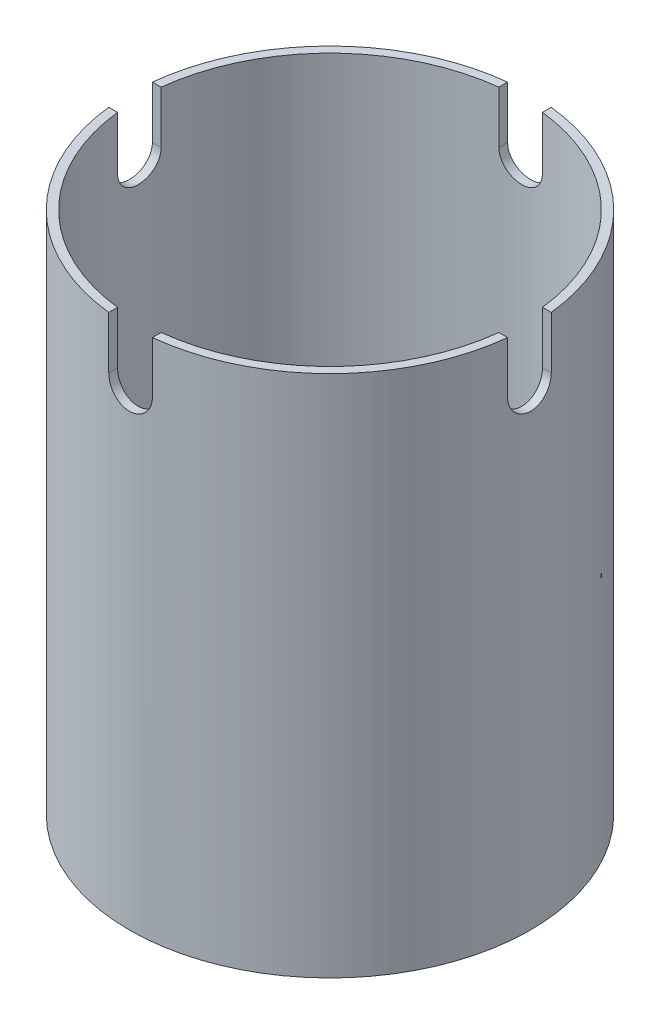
ISO-10303-21;
HEADER;
FILE_DESCRIPTION(('STEP AP214'),'2;1');
FILE_NAME('part.step','',(''),(''),'','','');
FILE_SCHEMA(('AUTOMOTIVE_DESIGN { 1 0 10303 214 1 1 1 1 }'));
ENDSEC;
DATA;
#1=APPLICATION_CONTEXT('core data for automotive mechanical design processes');
#2=APPLICATION_PROTOCOL_DEFINITION('international standard','automotive_design',2000,#1);
#3=PRODUCT_CONTEXT('',#1,'mechanical');
#4=PRODUCT('Part','Part','',(#3));
#5=PRODUCT_RELATED_PRODUCT_CATEGORY('part','',(#4));
#6=PRODUCT_DEFINITION_FORMATION('','',#4);
#7=PRODUCT_DEFINITION_CONTEXT('part definition',#1,'design');
#8=PRODUCT_DEFINITION('design','',#6,#7);
#9=PRODUCT_DEFINITION_SHAPE('','',#8);
#10=(LENGTH_UNIT() NAMED_UNIT(*) SI_UNIT(.MILLI.,.METRE.));
#11=(NAMED_UNIT(*) PLANE_ANGLE_UNIT() SI_UNIT($,.RADIAN.));
#12=(NAMED_UNIT(*) SI_UNIT($,.STERADIAN.) SOLID_ANGLE_UNIT());
#13=UNCERTAINTY_MEASURE_WITH_UNIT(LENGTH_MEASURE(1.E-05),#10,'distance_accuracy_value','');
#14=(GEOMETRIC_REPRESENTATION_CONTEXT(3) GLOBAL_UNCERTAINTY_ASSIGNED_CONTEXT((#13)) GLOBAL_UNIT_ASSIGNED_CONTEXT((#10,
#11,#12)) REPRESENTATION_CONTEXT('',''));
#15=CARTESIAN_POINT('',(0.,0.,0.));
#16=DIRECTION('',(0.,0.,1.));
#17=DIRECTION('',(1.,0.,0.));
#18=AXIS2_PLACEMENT_3D('',#15,#16,#17);
#19=CARTESIAN_POINT('',(0.,392.,0.));
#20=DIRECTION('',(0.,1.,0.));
#21=DIRECTION('',(0.,0.,1.));
#22=AXIS2_PLACEMENT_3D('',#19,#20,#21);
#23=CYLINDRICAL_SURFACE('',#22,11.);
#24=CARTESIAN_POINT('',(0.,392.,0.));
#25=DIRECTION('',(0.,1.,0.));
#26=DIRECTION('',(0.,0.,1.));
#27=AXIS2_PLACEMENT_3D('',#24,#25,#26);
#28=CIRCLE('',#27,11.);
#29=CARTESIAN_POINT('',(0.,392.,11.));
#30=VERTEX_POINT('',#29);
#31=EDGE_CURVE('E239',#30,#30,#28,.F.);
#32=ORIENTED_EDGE('',*,*,#31,.T.);
#33=EDGE_LOOP('',(#32));
#34=FACE_BOUND('',#33,.T.);
#35=DIRECTION('',(0.,1.,0.));
#36=VECTOR('',#35,1.);
#37=CARTESIAN_POINT('',(-1.24999999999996,422.,10.9287464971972));
#38=LINE('',#37,#36);
#39=CARTESIAN_POINT('',(-1.24999999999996,422.,10.9287464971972));
#40=VERTEX_POINT('',#39);
#41=CARTESIAN_POINT('',(-1.24999999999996,419.,10.9287464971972));
#42=VERTEX_POINT('',#41);
#43=EDGE_CURVE('E128',#40,#42,#38,.F.);
#44=ORIENTED_EDGE('',*,*,#43,.T.);
#45=CARTESIAN_POINT('',(-1.24999999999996,419.,10.9287464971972));
#46=CARTESIAN_POINT('',(-1.24999990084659,418.964953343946,10.9287455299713));
#47=CARTESIAN_POINT('',(-1.24852515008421,418.929923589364,10.9289152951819));
#48=CARTESIAN_POINT('',(-1.2426426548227,418.860116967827,10.9295860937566));
#49=CARTESIAN_POINT('',(-1.23823512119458,418.825340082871,10.9300871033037));
#50=CARTESIAN_POINT('',(-1.22065923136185,418.72183778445,10.9320692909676));
#51=CARTESIAN_POINT('',(-1.20313744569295,418.653809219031,10.9340297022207));
#52=CARTESIAN_POINT('',(-1.15698733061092,418.521684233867,10.9390087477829));
#53=CARTESIAN_POINT('',(-1.12835490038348,418.4575892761,10.9420277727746));
#54=CARTESIAN_POINT('',(-1.06080766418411,418.33511321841,10.9487823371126));
#55=CARTESIAN_POINT('',(-1.02189430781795,418.276731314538,10.9525177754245));
#56=CARTESIAN_POINT('',(-0.934705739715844,418.16708221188,10.9603030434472));
#57=CARTESIAN_POINT('',(-0.886394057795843,418.115844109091,10.9643540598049));
#58=CARTESIAN_POINT('',(-0.781837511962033,418.022166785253,10.9723048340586));
#59=CARTESIAN_POINT('',(-0.725589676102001,417.979730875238,10.9762045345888));
#60=CARTESIAN_POINT('',(-0.606564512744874,417.904763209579,10.9834258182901));
#61=CARTESIAN_POINT('',(-0.543767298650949,417.872262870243,10.9867455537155));
#62=CARTESIAN_POINT('',(-0.413610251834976,417.818315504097,10.9924133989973));
#63=CARTESIAN_POINT('',(-0.346255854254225,417.796855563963,10.994762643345));
#64=CARTESIAN_POINT('',(-0.232112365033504,417.770851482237,10.9976454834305));
#65=CARTESIAN_POINT('',(-0.186049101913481,417.763043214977,10.9985242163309));
#66=CARTESIAN_POINT('',(-0.0933305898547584,417.752616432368,10.9997017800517));
#67=CARTESIAN_POINT('',(-0.0466753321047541,417.749997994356,11.0000006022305));
#68=CARTESIAN_POINT('',(0.0699714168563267,417.750003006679,10.9999990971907));
#69=CARTESIAN_POINT('',(0.139987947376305,417.7558950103,10.9993252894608));
#70=CARTESIAN_POINT('',(0.278075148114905,417.779308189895,10.9967021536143));
#71=CARTESIAN_POINT('',(0.346143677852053,417.796841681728,10.9947514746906));
#72=CARTESIAN_POINT('',(0.478316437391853,417.843017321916,10.989794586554));
#73=CARTESIAN_POINT('',(0.54242318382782,417.871652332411,10.9867890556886));
#74=CARTESIAN_POINT('',(0.664908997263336,417.939204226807,10.9800575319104));
#75=CARTESIAN_POINT('',(0.723289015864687,417.978119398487,10.9763316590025));
#76=CARTESIAN_POINT('',(0.83294211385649,418.065316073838,10.9685571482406));
#77=CARTESIAN_POINT('',(0.884185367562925,418.113634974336,10.9645072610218));
#78=CARTESIAN_POINT('',(0.977856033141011,418.218191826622,10.9565511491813));
#79=CARTESIAN_POINT('',(1.02028267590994,418.274430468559,10.9526449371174));
#80=CARTESIAN_POINT('',(1.09523073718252,418.393427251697,10.9454052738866));
#81=CARTESIAN_POINT('',(1.12772199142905,418.456204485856,10.942073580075));
#82=CARTESIAN_POINT('',(1.1816754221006,418.586359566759,10.9363789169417));
#83=CARTESIAN_POINT('',(1.20314372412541,418.653734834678,10.9340154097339));
#84=CARTESIAN_POINT('',(1.22915713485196,418.767929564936,10.9311152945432));
#85=CARTESIAN_POINT('',(1.23696739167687,418.814022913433,10.9302314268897));
#86=CARTESIAN_POINT('',(1.24738870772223,418.906737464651,10.9290452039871));
#87=CARTESIAN_POINT('',(1.25000679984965,418.953357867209,10.9287420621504));
#88=CARTESIAN_POINT('',(1.25000000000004,419.,10.9287464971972));
#89=B_SPLINE_CURVE_WITH_KNOTS('',3,(#45,#46,#47,#48,#49,#50,#51,#52,#53,#54,#55,#56,#57,#58,#59,
#60,#61,#62,#63,#64,#65,#66,#67,#68,#69,#70,#71,#72,#73,#74,#75,#76,#77,#78,#79,#80,#81,#82,#83,
#84,#85,#86,#87,#88),.UNSPECIFIED.,.F.,.F.,(4,2,2,2,2,2,2,2,2,2,2,2,2,2,2,2,2,2,2,2,2,4),(0.,
0.105075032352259,0.210142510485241,0.419887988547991,0.629710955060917,0.839504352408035,
1.0501287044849,1.26083214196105,1.4721950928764,1.68331025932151,1.82322044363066,
1.96313271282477,2.17287647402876,2.38284248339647,2.59267371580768,2.80247002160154,
3.01311835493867,3.22378505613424,3.43508514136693,3.64626767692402,3.7862674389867,
3.9260774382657),.UNSPECIFIED.);
#90=CARTESIAN_POINT('',(1.25000000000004,419.,10.9287464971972));
#91=VERTEX_POINT('',#90);
#92=EDGE_CURVE('E296',#42,#91,#89,.T.);
#93=ORIENTED_EDGE('',*,*,#92,.T.);
#94=DIRECTION('',(0.,1.,0.));
#95=VECTOR('',#94,1.);
#96=CARTESIAN_POINT('',(1.25000000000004,419.,10.9287464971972));
#97=LINE('',#96,#95);
#98=CARTESIAN_POINT('',(1.25000000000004,422.,10.9287464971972));
#99=VERTEX_POINT('',#98);
#100=EDGE_CURVE('E158',#91,#99,#97,.T.);
#101=ORIENTED_EDGE('',*,*,#100,.T.);
#102=CARTESIAN_POINT('',(0.,422.,0.));
#103=DIRECTION('',(0.,1.,0.));
#104=DIRECTION('',(0.,0.,1.));
#105=AXIS2_PLACEMENT_3D('',#102,#103,#104);
#106=CIRCLE('',#105,11.);
#107=CARTESIAN_POINT('',(10.9287464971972,422.,1.25));
#108=VERTEX_POINT('',#107);
#109=EDGE_CURVE('E161',#108,#99,#106,.F.);
#110=ORIENTED_EDGE('',*,*,#109,.F.);
#111=DIRECTION('',(0.,-1.,0.));
#112=VECTOR('',#111,1.);
#113=CARTESIAN_POINT('',(10.9287464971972,419.,1.25));
#114=LINE('',#113,#112);
#115=CARTESIAN_POINT('',(10.9287464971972,419.,1.25));
#116=VERTEX_POINT('',#115);
#117=EDGE_CURVE('E163',#108,#116,#114,.T.);
#118=ORIENTED_EDGE('',*,*,#117,.T.);
#119=CARTESIAN_POINT('',(10.9287464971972,419.,1.25));
#120=CARTESIAN_POINT('',(10.9287455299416,418.964953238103,1.24999990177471));
#121=CARTESIAN_POINT('',(10.9289152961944,418.929923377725,1.24852514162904));
#122=CARTESIAN_POINT('',(10.9295860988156,418.860116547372,1.24264261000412));
#123=CARTESIAN_POINT('',(10.9300871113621,418.825339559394,1.23823504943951));
#124=CARTESIAN_POINT('',(10.9320693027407,418.721837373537,1.22065912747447));
#125=CARTESIAN_POINT('',(10.9340297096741,418.653809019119,1.20313738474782));
#126=CARTESIAN_POINT('',(10.9390086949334,418.52168563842,1.15698781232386));
#127=CARTESIAN_POINT('',(10.9420276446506,418.457592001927,1.12835608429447));
#128=CARTESIAN_POINT('',(10.9487821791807,418.335115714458,1.06080936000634));
#129=CARTESIAN_POINT('',(10.9525176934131,418.276732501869,1.02189537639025));
#130=CARTESIAN_POINT('',(10.9603034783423,418.16707605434,0.934700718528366));
#131=CARTESIAN_POINT('',(10.9643549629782,418.115832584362,0.886382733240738));
#132=CARTESIAN_POINT('',(10.9723057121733,418.022157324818,0.78182541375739));
#133=CARTESIAN_POINT('',(10.9762049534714,417.979726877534,0.725584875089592));
#134=CARTESIAN_POINT('',(10.9834238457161,417.904783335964,0.606594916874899));
#135=CARTESIAN_POINT('',(10.9867419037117,417.872297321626,0.543828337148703));
#136=CARTESIAN_POINT('',(10.9924108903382,417.818339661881,0.413690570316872));
#137=CARTESIAN_POINT('',(10.9947619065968,417.796867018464,0.346319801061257));
#138=CARTESIAN_POINT('',(10.9982235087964,417.765632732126,0.209191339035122));
#139=CARTESIAN_POINT('',(10.999339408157,417.755820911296,0.139445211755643));
#140=CARTESIAN_POINT('',(11.0002231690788,417.748031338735,-0.000713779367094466));
#141=CARTESIAN_POINT('',(10.9999910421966,417.750053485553,-0.071126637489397));
#142=CARTESIAN_POINT('',(10.9982091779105,417.765834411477,-0.210275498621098));
#143=CARTESIAN_POINT('',(10.9966655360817,417.779538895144,-0.279017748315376));
#144=CARTESIAN_POINT('',(10.9924410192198,417.818210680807,-0.413219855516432));
#145=CARTESIAN_POINT('',(10.9897601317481,417.843178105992,-0.478679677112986));
#146=CARTESIAN_POINT('',(10.9835518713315,417.903726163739,-0.604629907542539));
#147=CARTESIAN_POINT('',(10.9800225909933,417.939330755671,-0.66510870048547));
#148=CARTESIAN_POINT('',(10.9725131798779,418.020123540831,-0.77925040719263));
#149=CARTESIAN_POINT('',(10.968533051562,418.065311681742,-0.832913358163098));
#150=CARTESIAN_POINT('',(10.9605417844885,418.164286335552,-0.932214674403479));
#151=CARTESIAN_POINT('',(10.9565305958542,418.218118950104,-0.977807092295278));
#152=CARTESIAN_POINT('',(10.9489498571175,418.332717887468,-1.05932965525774));
#153=CARTESIAN_POINT('',(10.9453804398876,418.393486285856,-1.0952568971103));
#154=CARTESIAN_POINT('',(10.9390868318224,418.520278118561,-1.15642963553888));
#155=CARTESIAN_POINT('',(10.9363634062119,418.586306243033,-1.18166546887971));
#156=CARTESIAN_POINT('',(10.9320823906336,418.721652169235,-1.22064143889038));
#157=CARTESIAN_POINT('',(10.9305230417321,418.790964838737,-1.23439892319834));
#158=CARTESIAN_POINT('',(10.9293375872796,418.883974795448,-1.24482230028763));
#159=CARTESIAN_POINT('',(10.9291160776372,418.90715731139,-1.24676487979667));
#160=CARTESIAN_POINT('',(10.9288207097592,418.953556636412,-1.24935198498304));
#161=CARTESIAN_POINT('',(10.9287466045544,418.976773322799,-1.24999868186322));
#162=CARTESIAN_POINT('',(10.9287464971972,419.,-1.25));
#163=B_SPLINE_CURVE_WITH_KNOTS('',3,(#119,#120,#121,#122,#123,#124,#125,#126,#127,#128,#129,
#130,#131,#132,#133,#134,#135,#136,#137,#138,#139,#140,#141,#142,#143,#144,#145,#146,#147,#148,
#149,#150,#151,#152,#153,#154,#155,#156,#157,#158,#159,#160,#161,#162),.UNSPECIFIED.,.F.,.F.,(4,
2,2,2,2,2,2,2,2,2,2,2,2,2,2,2,2,2,2,2,2,4),(0.,0.105075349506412,0.210143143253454,
0.419887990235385,0.629706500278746,0.839504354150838,1.05015221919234,1.26083214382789,
1.47208077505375,1.6833102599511,1.89362746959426,2.10394287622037,2.31328610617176,
2.52263162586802,2.73245228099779,2.9422717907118,3.15324990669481,3.36429132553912,
3.57552308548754,3.78643502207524,3.85620296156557,3.92585390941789),.UNSPECIFIED.);
#164=CARTESIAN_POINT('',(10.9287464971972,419.,-1.25));
#165=VERTEX_POINT('',#164);
#166=EDGE_CURVE('E286',#116,#165,#163,.T.);
#167=ORIENTED_EDGE('',*,*,#166,.T.);
#168=DIRECTION('',(0.,1.,0.));
#169=VECTOR('',#168,1.);
#170=CARTESIAN_POINT('',(10.9287464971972,422.,-1.25));
#171=LINE('',#170,#169);
#172=CARTESIAN_POINT('',(10.9287464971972,422.,-1.25));
#173=VERTEX_POINT('',#172);
#174=EDGE_CURVE('E167',#165,#173,#171,.T.);
#175=ORIENTED_EDGE('',*,*,#174,.T.);
#176=CARTESIAN_POINT('',(0.,422.,0.));
#177=DIRECTION('',(0.,1.,0.));
#178=DIRECTION('',(0.,0.,1.));
#179=AXIS2_PLACEMENT_3D('',#176,#177,#178);
#180=CIRCLE('',#179,11.);
#181=CARTESIAN_POINT('',(1.24999999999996,422.,-10.9287464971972));
#182=VERTEX_POINT('',#181);
#183=EDGE_CURVE('E170',#182,#173,#180,.F.);
#184=ORIENTED_EDGE('',*,*,#183,.F.);
#185=DIRECTION('',(0.,1.,0.));
#186=VECTOR('',#185,1.);
#187=CARTESIAN_POINT('',(1.24999999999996,419.,-10.9287464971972));
#188=LINE('',#187,#186);
#189=CARTESIAN_POINT('',(1.24999999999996,419.,-10.9287464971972));
#190=VERTEX_POINT('',#189);
#191=EDGE_CURVE('E171',#182,#190,#188,.F.);
#192=ORIENTED_EDGE('',*,*,#191,.T.);
#193=CARTESIAN_POINT('',(1.24999999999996,419.,-10.9287464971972));
#194=CARTESIAN_POINT('',(1.24999990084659,418.964953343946,-10.9287455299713));
#195=CARTESIAN_POINT('',(1.24852515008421,418.929923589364,-10.9289152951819));
#196=CARTESIAN_POINT('',(1.2426426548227,418.860116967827,-10.9295860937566));
#197=CARTESIAN_POINT('',(1.23823512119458,418.825340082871,-10.9300871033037));
#198=CARTESIAN_POINT('',(1.22065923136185,418.72183778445,-10.9320692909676));
#199=CARTESIAN_POINT('',(1.20313744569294,418.653809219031,-10.9340297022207));
#200=CARTESIAN_POINT('',(1.15698733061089,418.521684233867,-10.9390087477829));
#201=CARTESIAN_POINT('',(1.12835490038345,418.4575892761,-10.9420277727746));
#202=CARTESIAN_POINT('',(1.06080766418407,418.33511321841,-10.9487823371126));
#203=CARTESIAN_POINT('',(1.02189430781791,418.276731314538,-10.9525177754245));
#204=CARTESIAN_POINT('',(0.934705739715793,418.16708221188,-10.9603030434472));
#205=CARTESIAN_POINT('',(0.886394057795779,418.115844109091,-10.9643540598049));
#206=CARTESIAN_POINT('',(0.781837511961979,418.022166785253,-10.9723048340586));
#207=CARTESIAN_POINT('',(0.725589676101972,417.979730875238,-10.9762045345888));
#208=CARTESIAN_POINT('',(0.606564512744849,417.904763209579,-10.9834258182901));
#209=CARTESIAN_POINT('',(0.543767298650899,417.872262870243,-10.9867455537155));
#210=CARTESIAN_POINT('',(0.41361025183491,417.818315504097,-10.9924133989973));
#211=CARTESIAN_POINT('',(0.346255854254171,417.796855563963,-10.994762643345));
#212=CARTESIAN_POINT('',(0.232112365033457,417.770851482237,-10.9976454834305));
#213=CARTESIAN_POINT('',(0.186049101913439,417.763043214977,-10.9985242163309));
#214=CARTESIAN_POINT('',(0.0933305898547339,417.752616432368,-10.9997017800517));
#215=CARTESIAN_POINT('',(0.0466753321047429,417.749997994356,-11.0000006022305));
#216=CARTESIAN_POINT('',(-0.0699714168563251,417.750003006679,-10.9999990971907));
#217=CARTESIAN_POINT('',(-0.139987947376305,417.7558950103,-10.9993252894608));
#218=CARTESIAN_POINT('',(-0.278075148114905,417.779308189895,-10.9967021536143));
#219=CARTESIAN_POINT('',(-0.346143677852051,417.796841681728,-10.9947514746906));
#220=CARTESIAN_POINT('',(-0.478316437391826,417.843017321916,-10.989794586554));
#221=CARTESIAN_POINT('',(-0.542423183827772,417.871652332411,-10.9867890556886));
#222=CARTESIAN_POINT('',(-0.664908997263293,417.939204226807,-10.9800575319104));
#223=CARTESIAN_POINT('',(-0.723289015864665,417.978119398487,-10.9763316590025));
#224=CARTESIAN_POINT('',(-0.832942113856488,418.065316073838,-10.9685571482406));
#225=CARTESIAN_POINT('',(-0.884185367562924,418.113634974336,-10.9645072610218));
#226=CARTESIAN_POINT('',(-0.977856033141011,418.218191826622,-10.9565511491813));
#227=CARTESIAN_POINT('',(-1.02028267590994,418.274430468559,-10.9526449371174));
#228=CARTESIAN_POINT('',(-1.09523073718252,418.393427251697,-10.9454052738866));
#229=CARTESIAN_POINT('',(-1.12772199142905,418.456204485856,-10.942073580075));
#230=CARTESIAN_POINT('',(-1.18167542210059,418.586359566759,-10.9363789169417));
#231=CARTESIAN_POINT('',(-1.20314372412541,418.653734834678,-10.9340154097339));
#232=CARTESIAN_POINT('',(-1.22915713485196,418.767929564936,-10.9311152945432));
#233=CARTESIAN_POINT('',(-1.23696739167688,418.814022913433,-10.9302314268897));
#234=CARTESIAN_POINT('',(-1.24738870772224,418.906737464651,-10.9290452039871));
#235=CARTESIAN_POINT('',(-1.25000679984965,418.953357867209,-10.9287420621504));
#236=CARTESIAN_POINT('',(-1.25000000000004,419.,-10.9287464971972));
#237=B_SPLINE_CURVE_WITH_KNOTS('',3,(#193,#194,#195,#196,#197,#198,#199,#200,#201,#202,#203,
#204,#205,#206,#207,#208,#209,#210,#211,#212,#213,#214,#215,#216,#217,#218,#219,#220,#221,#222,
#223,#224,#225,#226,#227,#228,#229,#230,#231,#232,#233,#234,#235,#236),.UNSPECIFIED.,.F.,.F.,(4,
2,2,2,2,2,2,2,2,2,2,2,2,2,2,2,2,2,2,2,2,4),(0.,0.105075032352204,0.210142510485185,
0.419887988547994,0.629710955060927,0.83950435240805,1.05012870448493,1.260832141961,
1.4721950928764,1.68331025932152,1.82322044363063,1.96313271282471,2.1728764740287,
2.38284248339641,2.59267371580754,2.80247002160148,3.01311835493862,3.22378505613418,
3.43508514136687,3.64626767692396,3.7862674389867,3.9260774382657),.UNSPECIFIED.);
#238=CARTESIAN_POINT('',(-1.25000000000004,419.,-10.9287464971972));
#239=VERTEX_POINT('',#238);
#240=EDGE_CURVE('E242',#190,#239,#237,.T.);
#241=ORIENTED_EDGE('',*,*,#240,.T.);
#242=DIRECTION('',(0.,1.,0.));
#243=VECTOR('',#242,1.);
#244=CARTESIAN_POINT('',(-1.25000000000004,422.,-10.9287464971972));
#245=LINE('',#244,#243);
#246=CARTESIAN_POINT('',(-1.25000000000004,422.,-10.9287464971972));
#247=VERTEX_POINT('',#246);
#248=EDGE_CURVE('E176',#239,#247,#245,.T.);
#249=ORIENTED_EDGE('',*,*,#248,.T.);
#250=CARTESIAN_POINT('',(0.,422.,0.));
#251=DIRECTION('',(0.,1.,0.));
#252=DIRECTION('',(0.,0.,1.));
#253=AXIS2_PLACEMENT_3D('',#250,#251,#252);
#254=CIRCLE('',#253,11.);
#255=CARTESIAN_POINT('',(-10.9287464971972,422.,-1.25));
#256=VERTEX_POINT('',#255);
#257=EDGE_CURVE('E179',#256,#247,#254,.F.);
#258=ORIENTED_EDGE('',*,*,#257,.F.);
#259=DIRECTION('',(0.,1.,0.));
#260=VECTOR('',#259,1.);
#261=CARTESIAN_POINT('',(-10.9287464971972,422.,-1.25));
#262=LINE('',#261,#260);
#263=CARTESIAN_POINT('',(-10.9287464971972,419.,-1.25));
#264=VERTEX_POINT('',#263);
#265=EDGE_CURVE('E180',#256,#264,#262,.F.);
#266=ORIENTED_EDGE('',*,*,#265,.T.);
#267=CARTESIAN_POINT('',(-10.9287464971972,419.,-1.25));
#268=CARTESIAN_POINT('',(-10.9287455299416,418.964953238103,-1.24999990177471));
#269=CARTESIAN_POINT('',(-10.9289152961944,418.929923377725,-1.24852514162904));
#270=CARTESIAN_POINT('',(-10.9295860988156,418.860116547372,-1.24264261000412));
#271=CARTESIAN_POINT('',(-10.9300871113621,418.825339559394,-1.23823504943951));
#272=CARTESIAN_POINT('',(-10.9320693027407,418.721837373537,-1.22065912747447));
#273=CARTESIAN_POINT('',(-10.9340297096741,418.653809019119,-1.20313738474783));
#274=CARTESIAN_POINT('',(-10.9390086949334,418.52168563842,-1.15698781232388));
#275=CARTESIAN_POINT('',(-10.9420276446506,418.457592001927,-1.12835608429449));
#276=CARTESIAN_POINT('',(-10.9487821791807,418.335115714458,-1.06080936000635));
#277=CARTESIAN_POINT('',(-10.9525176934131,418.276732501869,-1.02189537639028));
#278=CARTESIAN_POINT('',(-10.9603034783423,418.16707605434,-0.934700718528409));
#279=CARTESIAN_POINT('',(-10.9643549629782,418.115832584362,-0.88638273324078));
#280=CARTESIAN_POINT('',(-10.9723057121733,418.022157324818,-0.781825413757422));
#281=CARTESIAN_POINT('',(-10.9762049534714,417.979726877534,-0.725584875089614));
#282=CARTESIAN_POINT('',(-10.9834238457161,417.904783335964,-0.606594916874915));
#283=CARTESIAN_POINT('',(-10.9867419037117,417.872297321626,-0.543828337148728));
#284=CARTESIAN_POINT('',(-10.9924108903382,417.818339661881,-0.413690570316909));
#285=CARTESIAN_POINT('',(-10.9947619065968,417.796867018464,-0.3463198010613));
#286=CARTESIAN_POINT('',(-10.9982235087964,417.765632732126,-0.209191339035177));
#287=CARTESIAN_POINT('',(-10.999339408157,417.755820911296,-0.139445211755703));
#288=CARTESIAN_POINT('',(-11.0002231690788,417.748031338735,0.000713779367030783));
#289=CARTESIAN_POINT('',(-10.9999910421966,417.750053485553,0.0711266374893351));
#290=CARTESIAN_POINT('',(-10.9982091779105,417.765834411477,0.210275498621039));
#291=CARTESIAN_POINT('',(-10.9966655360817,417.779538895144,0.279017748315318));
#292=CARTESIAN_POINT('',(-10.9924410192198,417.818210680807,0.413219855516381));
#293=CARTESIAN_POINT('',(-10.9897601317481,417.843178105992,0.47867967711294));
#294=CARTESIAN_POINT('',(-10.9835518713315,417.903726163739,0.604629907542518));
#295=CARTESIAN_POINT('',(-10.9800225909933,417.939330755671,0.665108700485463));
#296=CARTESIAN_POINT('',(-10.9725131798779,418.020123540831,0.779250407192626));
#297=CARTESIAN_POINT('',(-10.968533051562,418.065311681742,0.832913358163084));
#298=CARTESIAN_POINT('',(-10.9605417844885,418.164286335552,0.932214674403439));
#299=CARTESIAN_POINT('',(-10.9565305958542,418.218118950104,0.977807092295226));
#300=CARTESIAN_POINT('',(-10.9489498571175,418.332717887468,1.05932965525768));
#301=CARTESIAN_POINT('',(-10.9453804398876,418.393486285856,1.09525689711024));
#302=CARTESIAN_POINT('',(-10.9390868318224,418.520278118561,1.15642963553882));
#303=CARTESIAN_POINT('',(-10.9363634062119,418.586306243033,1.18166546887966));
#304=CARTESIAN_POINT('',(-10.9320823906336,418.721652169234,1.22064143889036));
#305=CARTESIAN_POINT('',(-10.9305230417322,418.790964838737,1.23439892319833));
#306=CARTESIAN_POINT('',(-10.9293375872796,418.883974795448,1.24482230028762));
#307=CARTESIAN_POINT('',(-10.9291160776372,418.90715731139,1.24676487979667));
#308=CARTESIAN_POINT('',(-10.9288207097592,418.953556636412,1.24935198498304));
#309=CARTESIAN_POINT('',(-10.9287466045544,418.976773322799,1.24999868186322));
#310=CARTESIAN_POINT('',(-10.9287464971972,419.,1.25));
#311=B_SPLINE_CURVE_WITH_KNOTS('',3,(#267,#268,#269,#270,#271,#272,#273,#274,#275,#276,#277,
#278,#279,#280,#281,#282,#283,#284,#285,#286,#287,#288,#289,#290,#291,#292,#293,#294,#295,#296,
#297,#298,#299,#300,#301,#302,#303,#304,#305,#306,#307,#308,#309,#310),.UNSPECIFIED.,.F.,.F.,(4,
2,2,2,2,2,2,2,2,2,2,2,2,2,2,2,2,2,2,2,2,4),(0.,0.105075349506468,0.210143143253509,
0.419887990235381,0.629706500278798,0.839504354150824,1.05015221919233,1.26083214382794,
1.47208077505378,1.68331025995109,1.89362746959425,2.10394287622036,2.31328610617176,
2.522631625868,2.73245228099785,2.94227179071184,3.15324990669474,3.36429132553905,
3.57552308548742,3.78643502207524,3.85620296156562,3.92585390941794),.UNSPECIFIED.);
#312=CARTESIAN_POINT('',(-10.9287464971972,419.,1.25));
#313=VERTEX_POINT('',#312);
#314=EDGE_CURVE('E137',#264,#313,#311,.T.);
#315=ORIENTED_EDGE('',*,*,#314,.T.);
#316=DIRECTION('',(0.,-1.,0.));
#317=VECTOR('',#316,1.);
#318=CARTESIAN_POINT('',(-10.9287464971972,419.,1.25));
#319=LINE('',#318,#317);
#320=CARTESIAN_POINT('',(-10.9287464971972,422.,1.25));
#321=VERTEX_POINT('',#320);
#322=EDGE_CURVE('E133',#313,#321,#319,.F.);
#323=ORIENTED_EDGE('',*,*,#322,.T.);
#324=CARTESIAN_POINT('',(0.,422.,0.));
#325=DIRECTION('',(0.,1.,0.));
#326=DIRECTION('',(0.,0.,1.));
#327=AXIS2_PLACEMENT_3D('',#324,#325,#326);
#328=CIRCLE('',#327,11.);
#329=EDGE_CURVE('E21',#40,#321,#328,.F.);
#330=ORIENTED_EDGE('',*,*,#329,.F.);
#331=EDGE_LOOP('',(#44,#93,#101,#110,#118,#167,#175,#184,#192,#241,#249,#258,#266,#315,#323,#330));
#332=FACE_BOUND('',#331,.T.);
#333=ADVANCED_FACE('F17',(#34,#332),#23,.F.);
#334=CARTESIAN_POINT('',(-1.24999999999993,422.,20.));
#335=DIRECTION('',(-1.,0.,0.));
#336=DIRECTION('',(0.,0.,1.));
#337=AXIS2_PLACEMENT_3D('',#334,#335,#336);
#338=PLANE('',#337);
#339=DIRECTION('',(0.,0.,1.));
#340=VECTOR('',#339,1.);
#341=CARTESIAN_POINT('',(-1.24999999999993,419.,20.));
#342=LINE('',#341,#340);
#343=CARTESIAN_POINT('',(-1.24999999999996,419.,11.4318633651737));
#344=VERTEX_POINT('',#343);
#345=EDGE_CURVE('E293',#344,#42,#342,.F.);
#346=ORIENTED_EDGE('',*,*,#345,.T.);
#347=ORIENTED_EDGE('',*,*,#43,.F.);
#348=DIRECTION('',(0.,0.,1.));
#349=VECTOR('',#348,1.);
#350=CARTESIAN_POINT('',(-1.24999999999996,422.,0.));
#351=LINE('',#350,#349);
#352=CARTESIAN_POINT('',(-1.24999999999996,422.,11.4318633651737));
#353=VERTEX_POINT('',#352);
#354=EDGE_CURVE('E147',#353,#40,#351,.F.);
#355=ORIENTED_EDGE('',*,*,#354,.F.);
#356=DIRECTION('',(0.,1.,0.));
#357=VECTOR('',#356,1.);
#358=CARTESIAN_POINT('',(-1.24999999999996,392.,11.4318633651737));
#359=LINE('',#358,#357);
#360=EDGE_CURVE('E295',#344,#353,#359,.T.);
#361=ORIENTED_EDGE('',*,*,#360,.F.);
#362=EDGE_LOOP('',(#346,#347,#355,#361));
#363=FACE_BOUND('',#362,.T.);
#364=ADVANCED_FACE('F382',(#363),#338,.F.);
#365=CARTESIAN_POINT('',(0.,422.,0.));
#366=DIRECTION('',(0.,1.,0.));
#367=DIRECTION('',(0.,0.,1.));
#368=AXIS2_PLACEMENT_3D('',#365,#366,#367);
#369=PLANE('',#368);
#370=DIRECTION('',(1.,0.,0.));
#371=VECTOR('',#370,1.);
#372=CARTESIAN_POINT('',(-20.,422.,1.25));
#373=LINE('',#372,#371);
#374=CARTESIAN_POINT('',(-11.4318633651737,422.,1.24999999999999));
#375=VERTEX_POINT('',#374);
#376=EDGE_CURVE('E141',#321,#375,#373,.F.);
#377=ORIENTED_EDGE('',*,*,#376,.T.);
#378=CARTESIAN_POINT('',(0.,422.,0.));
#379=DIRECTION('',(0.,1.,0.));
#380=DIRECTION('',(0.,0.,1.));
#381=AXIS2_PLACEMENT_3D('',#378,#379,#380);
#382=CIRCLE('',#381,11.5);
#383=EDGE_CURVE('E219',#353,#375,#382,.F.);
#384=ORIENTED_EDGE('',*,*,#383,.F.);
#385=ORIENTED_EDGE('',*,*,#354,.T.);
#386=ORIENTED_EDGE('',*,*,#329,.T.);
#387=EDGE_LOOP('',(#377,#384,#385,#386));
#388=FACE_BOUND('',#387,.T.);
#389=ADVANCED_FACE('F144',(#388),#369,.T.);
#390=CARTESIAN_POINT('',(-20.,419.,1.25));
#391=DIRECTION('',(0.,0.,1.));
#392=DIRECTION('',(0.,-1.,0.));
#393=AXIS2_PLACEMENT_3D('',#390,#391,#392);
#394=PLANE('',#393);
#395=ORIENTED_EDGE('',*,*,#376,.F.);
#396=ORIENTED_EDGE('',*,*,#322,.F.);
#397=DIRECTION('',(1.,0.,0.));
#398=VECTOR('',#397,1.);
#399=CARTESIAN_POINT('',(-20.,419.,1.25));
#400=LINE('',#399,#398);
#401=CARTESIAN_POINT('',(-11.4318633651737,419.,1.25));
#402=VERTEX_POINT('',#401);
#403=EDGE_CURVE('E153',#313,#402,#400,.F.);
#404=ORIENTED_EDGE('',*,*,#403,.T.);
#405=DIRECTION('',(0.,1.,0.));
#406=VECTOR('',#405,1.);
#407=CARTESIAN_POINT('',(-11.4318633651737,392.,1.24999999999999));
#408=LINE('',#407,#406);
#409=EDGE_CURVE('E150',#375,#402,#408,.F.);
#410=ORIENTED_EDGE('',*,*,#409,.F.);
#411=EDGE_LOOP('',(#395,#396,#404,#410));
#412=FACE_BOUND('',#411,.T.);
#413=ADVANCED_FACE('F148',(#412),#394,.F.);
#414=CARTESIAN_POINT('',(-20.,419.,0.));
#415=DIRECTION('',(1.,0.,0.));
#416=DIRECTION('',(0.,0.,-1.));
#417=AXIS2_PLACEMENT_3D('',#414,#415,#416);
#418=CYLINDRICAL_SURFACE('',#417,1.25);
#419=ORIENTED_EDGE('',*,*,#403,.F.);
#420=ORIENTED_EDGE('',*,*,#314,.F.);
#421=DIRECTION('',(1.,0.,0.));
#422=VECTOR('',#421,1.);
#423=CARTESIAN_POINT('',(-20.,419.,-1.25));
#424=LINE('',#423,#422);
#425=CARTESIAN_POINT('',(-11.4318633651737,419.,-1.25));
#426=VERTEX_POINT('',#425);
#427=EDGE_CURVE('E181',#264,#426,#424,.F.);
#428=ORIENTED_EDGE('',*,*,#427,.T.);
#429=CARTESIAN_POINT('',(-11.4318633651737,419.,1.25));
#430=CARTESIAN_POINT('',(-11.4318624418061,418.964942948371,1.24999989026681));
#431=CARTESIAN_POINT('',(-11.4320248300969,418.929902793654,1.2485242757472));
#432=CARTESIAN_POINT('',(-11.4326664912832,418.860075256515,1.24263826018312));
#433=CARTESIAN_POINT('',(-11.4331457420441,418.825287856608,1.23822806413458));
#434=CARTESIAN_POINT('',(-11.4350418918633,418.721752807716,1.22064119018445));
#435=CARTESIAN_POINT('',(-11.4369172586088,418.653701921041,1.20310808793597));
#436=CARTESIAN_POINT('',(-11.4416805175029,418.521533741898,1.15692661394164));
#437=CARTESIAN_POINT('',(-11.4445687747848,418.45741787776,1.12827423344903));
#438=CARTESIAN_POINT('',(-11.4510310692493,418.334901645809,1.06067708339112));
#439=CARTESIAN_POINT('',(-11.4546050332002,418.276500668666,1.02173341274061));
#440=CARTESIAN_POINT('',(-11.4620527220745,418.166835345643,0.934486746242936));
#441=CARTESIAN_POINT('',(-11.4659275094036,418.115598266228,0.886149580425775));
#442=CARTESIAN_POINT('',(-11.4735311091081,418.02194053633,0.78155491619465));
#443=CARTESIAN_POINT('',(-11.477259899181,417.97952122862,0.725296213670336));
#444=CARTESIAN_POINT('',(-11.4841617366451,417.904614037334,0.606287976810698));
#445=CARTESIAN_POINT('',(-11.4873333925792,417.872150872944,0.543522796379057));
#446=CARTESIAN_POINT('',(-11.4927516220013,417.81823719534,0.413395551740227));
#447=CARTESIAN_POINT('',(-11.4949982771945,417.796785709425,0.346033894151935));
#448=CARTESIAN_POINT('',(-11.4983060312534,417.765583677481,0.208904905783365));
#449=CARTESIAN_POINT('',(-11.4993717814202,417.755787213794,0.139148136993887));
#450=CARTESIAN_POINT('',(-11.5002134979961,417.748031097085,-0.00102871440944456));
#451=CARTESIAN_POINT('',(-11.4999894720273,417.750071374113,-0.0714487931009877));
#452=CARTESIAN_POINT('',(-11.4982806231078,417.765894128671,-0.210637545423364));
#453=CARTESIAN_POINT('',(-11.4968011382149,417.77962689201,-0.279411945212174));
#454=CARTESIAN_POINT('',(-11.4927537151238,417.818367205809,-0.413673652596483));
#455=CARTESIAN_POINT('',(-11.4901857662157,417.843374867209,-0.479160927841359));
#456=CARTESIAN_POINT('',(-11.4842408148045,417.904009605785,-0.605146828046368));
#457=CARTESIAN_POINT('',(-11.4808621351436,417.939658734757,-0.665634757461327));
#458=CARTESIAN_POINT('',(-11.4736746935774,418.020546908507,-0.779785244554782));
#459=CARTESIAN_POINT('',(-11.4698659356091,418.065785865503,-0.833447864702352));
#460=CARTESIAN_POINT('',(-11.4622224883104,418.164841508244,-0.932711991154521));
#461=CARTESIAN_POINT('',(-11.4583877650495,418.218700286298,-0.97827149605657));
#462=CARTESIAN_POINT('',(-11.4511424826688,418.333343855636,-1.0597235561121));
#463=CARTESIAN_POINT('',(-11.4477320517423,418.394130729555,-1.09561319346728));
#464=CARTESIAN_POINT('',(-11.4417208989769,418.520946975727,-1.15670641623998));
#465=CARTESIAN_POINT('',(-11.4391208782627,418.58698082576,-1.18190075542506));
#466=CARTESIAN_POINT('',(-11.4350360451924,418.722327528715,-1.22079462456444));
#467=CARTESIAN_POINT('',(-11.4335495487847,418.791635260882,-1.23451151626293));
#468=CARTESIAN_POINT('',(-11.4324230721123,418.884527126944,-1.24487157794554));
#469=CARTESIAN_POINT('',(-11.4322133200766,418.907599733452,-1.24679567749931));
#470=CARTESIAN_POINT('',(-11.4319336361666,418.95377833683,-1.24935815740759));
#471=CARTESIAN_POINT('',(-11.431863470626,418.976884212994,-1.24999868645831));
#472=CARTESIAN_POINT('',(-11.4318633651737,419.,-1.25));
#473=B_SPLINE_CURVE_WITH_KNOTS('',3,(#429,#430,#431,#432,#433,#434,#435,#436,#437,#438,#439,
#440,#441,#442,#443,#444,#445,#446,#447,#448,#449,#450,#451,#452,#453,#454,#455,#456,#457,#458,
#459,#460,#461,#462,#463,#464,#465,#466,#467,#468,#469,#470,#471,#472),.UNSPECIFIED.,.F.,.F.,(4,
2,2,2,2,2,2,2,2,2,2,2,2,2,2,2,2,2,2,2,2,4),(0.,0.105106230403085,0.210205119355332,
0.420016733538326,0.629904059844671,0.839768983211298,1.05041210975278,1.2610872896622,
1.47228137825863,1.68345680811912,1.89379747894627,2.10413690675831,2.31358645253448,
2.52303805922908,2.73292675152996,2.94281352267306,3.15375837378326,3.36476680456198,
3.57595728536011,3.78682772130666,3.85626262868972,3.92558120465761),.UNSPECIFIED.);
#474=EDGE_CURVE('E209',#402,#426,#473,.T.);
#475=ORIENTED_EDGE('',*,*,#474,.F.);
#476=EDGE_LOOP('',(#419,#420,#428,#475));
#477=FACE_BOUND('',#476,.T.);
#478=ADVANCED_FACE('F221',(#477),#418,.F.);
#479=CARTESIAN_POINT('',(-20.,422.,-1.25));
#480=DIRECTION('',(0.,0.,-1.));
#481=DIRECTION('',(0.,1.,0.));
#482=AXIS2_PLACEMENT_3D('',#479,#480,#481);
#483=PLANE('',#482);
#484=ORIENTED_EDGE('',*,*,#427,.F.);
#485=ORIENTED_EDGE('',*,*,#265,.F.);
#486=DIRECTION('',(1.,0.,0.));
#487=VECTOR('',#486,1.);
#488=CARTESIAN_POINT('',(0.,422.,-1.25));
#489=LINE('',#488,#487);
#490=CARTESIAN_POINT('',(-11.4318633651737,422.,-1.25));
#491=VERTEX_POINT('',#490);
#492=EDGE_CURVE('E236',#491,#256,#489,.T.);
#493=ORIENTED_EDGE('',*,*,#492,.F.);
#494=DIRECTION('',(0.,1.,0.));
#495=VECTOR('',#494,1.);
#496=CARTESIAN_POINT('',(-11.4318633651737,392.,-1.25));
#497=LINE('',#496,#495);
#498=EDGE_CURVE('E217',#426,#491,#497,.T.);
#499=ORIENTED_EDGE('',*,*,#498,.F.);
#500=EDGE_LOOP('',(#484,#485,#493,#499));
#501=FACE_BOUND('',#500,.T.);
#502=ADVANCED_FACE('F226',(#501),#483,.F.);
#503=CARTESIAN_POINT('',(0.,422.,0.));
#504=DIRECTION('',(0.,1.,0.));
#505=DIRECTION('',(0.,0.,1.));
#506=AXIS2_PLACEMENT_3D('',#503,#504,#505);
#507=PLANE('',#506);
#508=ORIENTED_EDGE('',*,*,#492,.T.);
#509=ORIENTED_EDGE('',*,*,#257,.T.);
#510=DIRECTION('',(0.,0.,1.));
#511=VECTOR('',#510,1.);
#512=CARTESIAN_POINT('',(-1.24999999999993,422.,20.));
#513=LINE('',#512,#511);
#514=CARTESIAN_POINT('',(-1.25000000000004,422.,-11.4318633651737));
#515=VERTEX_POINT('',#514);
#516=EDGE_CURVE('E178',#247,#515,#513,.F.);
#517=ORIENTED_EDGE('',*,*,#516,.T.);
#518=CARTESIAN_POINT('',(0.,422.,0.));
#519=DIRECTION('',(0.,1.,0.));
#520=DIRECTION('',(0.,0.,1.));
#521=AXIS2_PLACEMENT_3D('',#518,#519,#520);
#522=CIRCLE('',#521,11.5);
#523=EDGE_CURVE('E218',#491,#515,#522,.F.);
#524=ORIENTED_EDGE('',*,*,#523,.F.);
#525=EDGE_LOOP('',(#508,#509,#517,#524));
#526=FACE_BOUND('',#525,.T.);
#527=ADVANCED_FACE('F263',(#526),#507,.T.);
#528=CARTESIAN_POINT('',(-1.24999999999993,422.,20.));
#529=DIRECTION('',(-1.,0.,0.));
#530=DIRECTION('',(0.,0.,1.));
#531=AXIS2_PLACEMENT_3D('',#528,#529,#530);
#532=PLANE('',#531);
#533=ORIENTED_EDGE('',*,*,#516,.F.);
#534=ORIENTED_EDGE('',*,*,#248,.F.);
#535=DIRECTION('',(0.,0.,1.));
#536=VECTOR('',#535,1.);
#537=CARTESIAN_POINT('',(-1.24999999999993,419.,20.));
#538=LINE('',#537,#536);
#539=CARTESIAN_POINT('',(-1.25000000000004,419.,-11.4318633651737));
#540=VERTEX_POINT('',#539);
#541=EDGE_CURVE('E175',#239,#540,#538,.F.);
#542=ORIENTED_EDGE('',*,*,#541,.T.);
#543=DIRECTION('',(0.,1.,0.));
#544=VECTOR('',#543,1.);
#545=CARTESIAN_POINT('',(-1.25000000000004,392.,-11.4318633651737));
#546=LINE('',#545,#544);
#547=EDGE_CURVE('E301',#515,#540,#546,.F.);
#548=ORIENTED_EDGE('',*,*,#547,.F.);
#549=EDGE_LOOP('',(#533,#534,#542,#548));
#550=FACE_BOUND('',#549,.T.);
#551=ADVANCED_FACE('F260',(#550),#532,.F.);
#552=CARTESIAN_POINT('',(0.,392.,0.));
#553=DIRECTION('',(0.,1.,0.));
#554=DIRECTION('',(0.,0.,1.));
#555=AXIS2_PLACEMENT_3D('',#552,#553,#554);
#556=PLANE('',#555);
#557=CARTESIAN_POINT('',(0.,392.,0.));
#558=DIRECTION('',(0.,1.,0.));
#559=DIRECTION('',(0.,0.,1.));
#560=AXIS2_PLACEMENT_3D('',#557,#558,#559);
#561=CIRCLE('',#560,11.5);
#562=CARTESIAN_POINT('',(0.,392.,11.5));
#563=VERTEX_POINT('',#562);
#564=EDGE_CURVE('E304',#563,#563,#561,.T.);
#565=ORIENTED_EDGE('',*,*,#564,.F.);
#566=EDGE_LOOP('',(#565));
#567=FACE_BOUND('',#566,.T.);
#568=ORIENTED_EDGE('',*,*,#31,.F.);
#569=EDGE_LOOP('',(#568));
#570=FACE_BOUND('',#569,.T.);
#571=ADVANCED_FACE('F254',(#567,#570),#556,.F.);
#572=CARTESIAN_POINT('',(0.,419.,20.));
#573=DIRECTION('',(0.,0.,-1.));
#574=DIRECTION('',(-1.,0.,0.));
#575=AXIS2_PLACEMENT_3D('',#572,#573,#574);
#576=CYLINDRICAL_SURFACE('',#575,1.25);
#577=CARTESIAN_POINT('',(-1.25000000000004,419.,-11.4318633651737));
#578=CARTESIAN_POINT('',(-1.24999988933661,418.964943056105,-11.4318624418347));
#579=CARTESIAN_POINT('',(-1.24852428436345,418.929903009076,-11.4320248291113));
#580=CARTESIAN_POINT('',(-1.24263830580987,418.860075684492,-11.432666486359));
#581=CARTESIAN_POINT('',(-1.23822813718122,418.825288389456,-11.4331457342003));
#582=CARTESIAN_POINT('',(-1.22064129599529,418.721753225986,-11.4350418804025));
#583=CARTESIAN_POINT('',(-1.2031081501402,418.653702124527,-11.4369172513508));
#584=CARTESIAN_POINT('',(-1.15692612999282,418.521532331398,-11.4416805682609));
#585=CARTESIAN_POINT('',(-1.12827304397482,418.457415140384,-11.4445688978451));
#586=CARTESIAN_POINT('',(-1.06067537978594,418.334899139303,-11.4510312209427));
#587=CARTESIAN_POINT('',(-1.02173233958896,418.276499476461,-11.4546051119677));
#588=CARTESIAN_POINT('',(-0.934491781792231,418.166841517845,-11.462052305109));
#589=CARTESIAN_POINT('',(-0.886160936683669,418.115609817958,-11.4659266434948));
#590=CARTESIAN_POINT('',(-0.781567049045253,418.02195001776,-11.4735302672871));
#591=CARTESIAN_POINT('',(-0.72530103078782,417.979525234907,-11.4772594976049));
#592=CARTESIAN_POINT('',(-0.606257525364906,417.904593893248,-11.4841636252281));
#593=CARTESIAN_POINT('',(-0.543461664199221,417.872116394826,-11.4873368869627));
#594=CARTESIAN_POINT('',(-0.413315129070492,417.818213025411,-11.4927540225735));
#595=CARTESIAN_POINT('',(-0.34596987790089,417.796774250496,-11.4949989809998));
#596=CARTESIAN_POINT('',(-0.231881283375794,417.770809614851,-11.4977523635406));
#597=CARTESIAN_POINT('',(-0.185862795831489,417.763016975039,-11.498591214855));
#598=CARTESIAN_POINT('',(-0.093236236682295,417.752611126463,-11.4997153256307));
#599=CARTESIAN_POINT('',(-0.0466281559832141,417.749997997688,-11.5000005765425));
#600=CARTESIAN_POINT('',(0.0699924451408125,417.750003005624,-11.4999991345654));
#601=CARTESIAN_POINT('',(0.140030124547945,417.755898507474,-11.499354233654));
#602=CARTESIAN_POINT('',(0.278160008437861,417.77932624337,-11.4968436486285));
#603=CARTESIAN_POINT('',(0.346250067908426,417.796870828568,-11.4949766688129));
#604=CARTESIAN_POINT('',(0.478466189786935,417.843077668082,-11.490232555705));
#605=CARTESIAN_POINT('',(0.54259470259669,417.871732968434,-11.4873560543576));
#606=CARTESIAN_POINT('',(0.665119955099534,417.939334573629,-11.4809139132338));
#607=CARTESIAN_POINT('',(0.723517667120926,417.97827912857,-11.4773483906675));
#608=CARTESIAN_POINT('',(0.833180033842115,418.065527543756,-11.469910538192));
#609=CARTESIAN_POINT('',(0.884417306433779,418.113865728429,-11.4660371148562));
#610=CARTESIAN_POINT('',(0.97807118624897,418.218460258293,-11.4584287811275));
#611=CARTESIAN_POINT('',(1.02048703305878,418.274717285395,-11.4546938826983));
#612=CARTESIAN_POINT('',(1.09539908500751,418.393732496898,-11.4477738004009));
#613=CARTESIAN_POINT('',(1.12786755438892,418.456508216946,-11.4445901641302));
#614=CARTESIAN_POINT('',(1.18177719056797,418.586652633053,-11.4391495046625));
#615=CARTESIAN_POINT('',(1.20322444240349,418.654018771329,-11.436891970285));
#616=CARTESIAN_POINT('',(1.2291987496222,418.768159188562,-11.434123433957));
#617=CARTESIAN_POINT('',(1.23699353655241,418.814208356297,-11.4332801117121));
#618=CARTESIAN_POINT('',(1.24739397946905,418.906831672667,-11.432148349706));
#619=CARTESIAN_POINT('',(1.25000671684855,418.953405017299,-11.4318591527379));
#620=CARTESIAN_POINT('',(1.24999999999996,419.,-11.4318633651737));
#621=B_SPLINE_CURVE_WITH_KNOTS('',3,(#577,#578,#579,#580,#581,#582,#583,#584,#585,#586,#587,
#588,#589,#590,#591,#592,#593,#594,#595,#596,#597,#598,#599,#600,#601,#602,#603,#604,#605,#606,
#607,#608,#609,#610,#611,#612,#613,#614,#615,#616,#617,#618,#619,#620),.UNSPECIFIED.,.F.,.F.,(4,
2,2,2,2,2,2,2,2,2,2,2,2,2,2,2,2,2,2,2,2,4),(0.,0.105105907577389,0.210204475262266,
0.420016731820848,0.629908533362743,0.839768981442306,1.0503885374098,1.2610872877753,
1.47239583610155,1.68345680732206,1.82322569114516,1.96299673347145,2.17280380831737,
2.38283369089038,2.59273233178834,2.80259529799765,3.01324003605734,3.22390292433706,
3.43514795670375,3.64627623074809,3.78613649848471,3.92580551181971),.UNSPECIFIED.);
#622=CARTESIAN_POINT('',(1.24999999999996,419.,-11.4318633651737));
#623=VERTEX_POINT('',#622);
#624=EDGE_CURVE('E200',#540,#623,#621,.T.);
#625=ORIENTED_EDGE('',*,*,#624,.F.);
#626=ORIENTED_EDGE('',*,*,#541,.F.);
#627=ORIENTED_EDGE('',*,*,#240,.F.);
#628=DIRECTION('',(0.,0.,-1.));
#629=VECTOR('',#628,1.);
#630=CARTESIAN_POINT('',(1.25000000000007,419.,20.));
#631=LINE('',#630,#629);
#632=EDGE_CURVE('E174',#190,#623,#631,.T.);
#633=ORIENTED_EDGE('',*,*,#632,.T.);
#634=EDGE_LOOP('',(#625,#626,#627,#633));
#635=FACE_BOUND('',#634,.T.);
#636=ADVANCED_FACE('F248',(#635),#576,.F.);
#637=CARTESIAN_POINT('',(1.25000000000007,419.,20.));
#638=DIRECTION('',(1.,0.,0.));
#639=DIRECTION('',(0.,0.,-1.));
#640=AXIS2_PLACEMENT_3D('',#637,#638,#639);
#641=PLANE('',#640);
#642=ORIENTED_EDGE('',*,*,#632,.F.);
#643=ORIENTED_EDGE('',*,*,#191,.F.);
#644=DIRECTION('',(0.,0.,1.));
#645=VECTOR('',#644,1.);
#646=CARTESIAN_POINT('',(1.24999999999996,422.,0.));
#647=LINE('',#646,#645);
#648=CARTESIAN_POINT('',(1.24999999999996,422.,-11.4318633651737));
#649=VERTEX_POINT('',#648);
#650=EDGE_CURVE('E282',#649,#182,#647,.T.);
#651=ORIENTED_EDGE('',*,*,#650,.F.);
#652=DIRECTION('',(0.,1.,0.));
#653=VECTOR('',#652,1.);
#654=CARTESIAN_POINT('',(1.24999999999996,392.,-11.4318633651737));
#655=LINE('',#654,#653);
#656=EDGE_CURVE('E305',#623,#649,#655,.T.);
#657=ORIENTED_EDGE('',*,*,#656,.F.);
#658=EDGE_LOOP('',(#642,#643,#651,#657));
#659=FACE_BOUND('',#658,.T.);
#660=ADVANCED_FACE('F253',(#659),#641,.F.);
#661=CARTESIAN_POINT('',(0.,422.,0.));
#662=DIRECTION('',(0.,1.,0.));
#663=DIRECTION('',(0.,0.,1.));
#664=AXIS2_PLACEMENT_3D('',#661,#662,#663);
#665=PLANE('',#664);
#666=DIRECTION('',(1.,0.,0.));
#667=VECTOR('',#666,1.);
#668=CARTESIAN_POINT('',(-20.,422.,-1.25));
#669=LINE('',#668,#667);
#670=CARTESIAN_POINT('',(11.4318633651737,422.,-1.25));
#671=VERTEX_POINT('',#670);
#672=EDGE_CURVE('E169',#173,#671,#669,.T.);
#673=ORIENTED_EDGE('',*,*,#672,.T.);
#674=CARTESIAN_POINT('',(0.,422.,0.));
#675=DIRECTION('',(0.,1.,0.));
#676=DIRECTION('',(0.,0.,1.));
#677=AXIS2_PLACEMENT_3D('',#674,#675,#676);
#678=CIRCLE('',#677,11.5);
#679=EDGE_CURVE('E308',#649,#671,#678,.F.);
#680=ORIENTED_EDGE('',*,*,#679,.F.);
#681=ORIENTED_EDGE('',*,*,#650,.T.);
#682=ORIENTED_EDGE('',*,*,#183,.T.);
#683=EDGE_LOOP('',(#673,#680,#681,#682));
#684=FACE_BOUND('',#683,.T.);
#685=ADVANCED_FACE('F360',(#684),#665,.T.);
#686=CARTESIAN_POINT('',(-20.,422.,-1.25));
#687=DIRECTION('',(0.,0.,-1.));
#688=DIRECTION('',(0.,1.,0.));
#689=AXIS2_PLACEMENT_3D('',#686,#687,#688);
#690=PLANE('',#689);
#691=ORIENTED_EDGE('',*,*,#672,.F.);
#692=ORIENTED_EDGE('',*,*,#174,.F.);
#693=DIRECTION('',(1.,0.,0.));
#694=VECTOR('',#693,1.);
#695=CARTESIAN_POINT('',(-20.,419.,-1.25));
#696=LINE('',#695,#694);
#697=CARTESIAN_POINT('',(11.4318633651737,419.,-1.25));
#698=VERTEX_POINT('',#697);
#699=EDGE_CURVE('E166',#165,#698,#696,.T.);
#700=ORIENTED_EDGE('',*,*,#699,.T.);
#701=DIRECTION('',(0.,1.,0.));
#702=VECTOR('',#701,1.);
#703=CARTESIAN_POINT('',(11.4318633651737,392.,-1.25));
#704=LINE('',#703,#702);
#705=EDGE_CURVE('E309',#671,#698,#704,.F.);
#706=ORIENTED_EDGE('',*,*,#705,.F.);
#707=EDGE_LOOP('',(#691,#692,#700,#706));
#708=FACE_BOUND('',#707,.T.);
#709=ADVANCED_FACE('F344',(#708),#690,.F.);
#710=CARTESIAN_POINT('',(-20.,419.,0.));
#711=DIRECTION('',(1.,0.,0.));
#712=DIRECTION('',(0.,0.,-1.));
#713=AXIS2_PLACEMENT_3D('',#710,#711,#712);
#714=CYLINDRICAL_SURFACE('',#713,1.25);
#715=ORIENTED_EDGE('',*,*,#699,.F.);
#716=ORIENTED_EDGE('',*,*,#166,.F.);
#717=DIRECTION('',(1.,0.,0.));
#718=VECTOR('',#717,1.);
#719=CARTESIAN_POINT('',(-20.,419.,1.25));
#720=LINE('',#719,#718);
#721=CARTESIAN_POINT('',(11.4318633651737,419.,1.25));
#722=VERTEX_POINT('',#721);
#723=EDGE_CURVE('E165',#116,#722,#720,.T.);
#724=ORIENTED_EDGE('',*,*,#723,.T.);
#725=CARTESIAN_POINT('',(11.4318633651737,419.,-1.25));
#726=CARTESIAN_POINT('',(11.4318624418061,418.964942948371,-1.24999989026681));
#727=CARTESIAN_POINT('',(11.4320248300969,418.929902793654,-1.2485242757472));
#728=CARTESIAN_POINT('',(11.4326664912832,418.860075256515,-1.24263826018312));
#729=CARTESIAN_POINT('',(11.4331457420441,418.825287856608,-1.23822806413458));
#730=CARTESIAN_POINT('',(11.4350418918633,418.721752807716,-1.22064119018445));
#731=CARTESIAN_POINT('',(11.4369172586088,418.653701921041,-1.20310808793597));
#732=CARTESIAN_POINT('',(11.4416805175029,418.521533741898,-1.15692661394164));
#733=CARTESIAN_POINT('',(11.4445687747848,418.45741787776,-1.12827423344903));
#734=CARTESIAN_POINT('',(11.4510310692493,418.334901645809,-1.06067708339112));
#735=CARTESIAN_POINT('',(11.4546050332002,418.276500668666,-1.02173341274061));
#736=CARTESIAN_POINT('',(11.4620527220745,418.166835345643,-0.934486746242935));
#737=CARTESIAN_POINT('',(11.4659275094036,418.115598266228,-0.886149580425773));
#738=CARTESIAN_POINT('',(11.4735311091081,418.02194053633,-0.781554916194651));
#739=CARTESIAN_POINT('',(11.477259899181,417.97952122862,-0.72529621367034));
#740=CARTESIAN_POINT('',(11.4841617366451,417.904614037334,-0.606287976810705));
#741=CARTESIAN_POINT('',(11.4873333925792,417.872150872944,-0.543522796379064));
#742=CARTESIAN_POINT('',(11.4927516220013,417.81823719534,-0.413395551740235));
#743=CARTESIAN_POINT('',(11.4949982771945,417.796785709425,-0.346033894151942));
#744=CARTESIAN_POINT('',(11.4983060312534,417.765583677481,-0.208904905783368));
#745=CARTESIAN_POINT('',(11.4993717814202,417.755787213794,-0.139148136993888));
#746=CARTESIAN_POINT('',(11.5002134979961,417.748031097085,0.00102871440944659));
#747=CARTESIAN_POINT('',(11.4999894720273,417.750071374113,0.0714487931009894));
#748=CARTESIAN_POINT('',(11.4982806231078,417.765894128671,0.210637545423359));
#749=CARTESIAN_POINT('',(11.4968011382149,417.77962689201,0.279411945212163));
#750=CARTESIAN_POINT('',(11.4927537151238,417.818367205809,0.413673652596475));
#751=CARTESIAN_POINT('',(11.4901857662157,417.843374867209,0.479160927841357));
#752=CARTESIAN_POINT('',(11.4842408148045,417.904009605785,0.60514682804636));
#753=CARTESIAN_POINT('',(11.4808621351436,417.939658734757,0.665634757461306));
#754=CARTESIAN_POINT('',(11.4736746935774,418.020546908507,0.779785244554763));
#755=CARTESIAN_POINT('',(11.4698659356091,418.065785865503,0.833447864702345));
#756=CARTESIAN_POINT('',(11.4622224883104,418.164841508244,0.932711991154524));
#757=CARTESIAN_POINT('',(11.4583877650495,418.218700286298,0.978271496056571));
#758=CARTESIAN_POINT('',(11.4511424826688,418.333343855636,1.05972355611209));
#759=CARTESIAN_POINT('',(11.4477320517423,418.394130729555,1.09561319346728));
#760=CARTESIAN_POINT('',(11.4417208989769,418.520946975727,1.15670641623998));
#761=CARTESIAN_POINT('',(11.4391208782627,418.58698082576,1.18190075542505));
#762=CARTESIAN_POINT('',(11.4350360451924,418.722327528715,1.22079462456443));
#763=CARTESIAN_POINT('',(11.4335495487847,418.791635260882,1.23451151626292));
#764=CARTESIAN_POINT('',(11.4324230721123,418.884527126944,1.24487157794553));
#765=CARTESIAN_POINT('',(11.4322133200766,418.907599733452,1.24679567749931));
#766=CARTESIAN_POINT('',(11.4319336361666,418.95377833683,1.24935815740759));
#767=CARTESIAN_POINT('',(11.431863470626,418.976884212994,1.24999868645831));
#768=CARTESIAN_POINT('',(11.4318633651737,419.,1.25));
#769=B_SPLINE_CURVE_WITH_KNOTS('',3,(#725,#726,#727,#728,#729,#730,#731,#732,#733,#734,#735,
#736,#737,#738,#739,#740,#741,#742,#743,#744,#745,#746,#747,#748,#749,#750,#751,#752,#753,#754,
#755,#756,#757,#758,#759,#760,#761,#762,#763,#764,#765,#766,#767,#768),.UNSPECIFIED.,.F.,.F.,(4,
2,2,2,2,2,2,2,2,2,2,2,2,2,2,2,2,2,2,2,2,4),(0.,0.105106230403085,0.210205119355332,
0.420016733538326,0.629904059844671,0.839768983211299,1.05041210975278,1.2610872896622,
1.47228137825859,1.68345680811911,1.89379747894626,2.1041369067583,2.31358645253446,
2.52303805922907,2.73292675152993,2.94281352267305,3.15375837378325,3.36476680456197,
3.57595728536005,3.78682772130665,3.8562626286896,3.92558120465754),.UNSPECIFIED.);
#770=EDGE_CURVE('E312',#698,#722,#769,.T.);
#771=ORIENTED_EDGE('',*,*,#770,.F.);
#772=EDGE_LOOP('',(#715,#716,#724,#771));
#773=FACE_BOUND('',#772,.T.);
#774=ADVANCED_FACE('F339',(#773),#714,.F.);
#775=CARTESIAN_POINT('',(-20.,419.,1.25));
#776=DIRECTION('',(0.,0.,1.));
#777=DIRECTION('',(0.,-1.,0.));
#778=AXIS2_PLACEMENT_3D('',#775,#776,#777);
#779=PLANE('',#778);
#780=ORIENTED_EDGE('',*,*,#723,.F.);
#781=ORIENTED_EDGE('',*,*,#117,.F.);
#782=DIRECTION('',(1.,0.,0.));
#783=VECTOR('',#782,1.);
#784=CARTESIAN_POINT('',(0.,422.,1.25));
#785=LINE('',#784,#783);
#786=CARTESIAN_POINT('',(11.4318633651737,422.,1.25));
#787=VERTEX_POINT('',#786);
#788=EDGE_CURVE('E289',#787,#108,#785,.F.);
#789=ORIENTED_EDGE('',*,*,#788,.F.);
#790=DIRECTION('',(0.,1.,0.));
#791=VECTOR('',#790,1.);
#792=CARTESIAN_POINT('',(11.4318633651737,392.,1.25));
#793=LINE('',#792,#791);
#794=EDGE_CURVE('E313',#722,#787,#793,.T.);
#795=ORIENTED_EDGE('',*,*,#794,.F.);
#796=EDGE_LOOP('',(#780,#781,#789,#795));
#797=FACE_BOUND('',#796,.T.);
#798=ADVANCED_FACE('F334',(#797),#779,.F.);
#799=CARTESIAN_POINT('',(0.,422.,0.));
#800=DIRECTION('',(0.,1.,0.));
#801=DIRECTION('',(0.,0.,1.));
#802=AXIS2_PLACEMENT_3D('',#799,#800,#801);
#803=PLANE('',#802);
#804=ORIENTED_EDGE('',*,*,#788,.T.);
#805=ORIENTED_EDGE('',*,*,#109,.T.);
#806=DIRECTION('',(0.,0.,-1.));
#807=VECTOR('',#806,1.);
#808=CARTESIAN_POINT('',(1.25000000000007,422.,20.));
#809=LINE('',#808,#807);
#810=CARTESIAN_POINT('',(1.25000000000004,422.,11.4318633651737));
#811=VERTEX_POINT('',#810);
#812=EDGE_CURVE('E160',#99,#811,#809,.F.);
#813=ORIENTED_EDGE('',*,*,#812,.T.);
#814=CARTESIAN_POINT('',(0.,422.,0.));
#815=DIRECTION('',(0.,1.,0.));
#816=DIRECTION('',(0.,0.,1.));
#817=AXIS2_PLACEMENT_3D('',#814,#815,#816);
#818=CIRCLE('',#817,11.5);
#819=EDGE_CURVE('E188',#787,#811,#818,.F.);
#820=ORIENTED_EDGE('',*,*,#819,.F.);
#821=EDGE_LOOP('',(#804,#805,#813,#820));
#822=FACE_BOUND('',#821,.T.);
#823=ADVANCED_FACE('F323',(#822),#803,.T.);
#824=CARTESIAN_POINT('',(1.25000000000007,419.,20.));
#825=DIRECTION('',(1.,0.,0.));
#826=DIRECTION('',(0.,0.,-1.));
#827=AXIS2_PLACEMENT_3D('',#824,#825,#826);
#828=PLANE('',#827);
#829=ORIENTED_EDGE('',*,*,#812,.F.);
#830=ORIENTED_EDGE('',*,*,#100,.F.);
#831=DIRECTION('',(0.,0.,-1.));
#832=VECTOR('',#831,1.);
#833=CARTESIAN_POINT('',(1.25000000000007,419.,20.));
#834=LINE('',#833,#832);
#835=CARTESIAN_POINT('',(1.25000000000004,419.,11.4318633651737));
#836=VERTEX_POINT('',#835);
#837=EDGE_CURVE('E36',#91,#836,#834,.F.);
#838=ORIENTED_EDGE('',*,*,#837,.T.);
#839=DIRECTION('',(0.,1.,0.));
#840=VECTOR('',#839,1.);
#841=CARTESIAN_POINT('',(1.25000000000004,392.,11.4318633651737));
#842=LINE('',#841,#840);
#843=EDGE_CURVE('E27',#811,#836,#842,.F.);
#844=ORIENTED_EDGE('',*,*,#843,.F.);
#845=EDGE_LOOP('',(#829,#830,#838,#844));
#846=FACE_BOUND('',#845,.T.);
#847=ADVANCED_FACE('F327',(#846),#828,.F.);
#848=CARTESIAN_POINT('',(0.,419.,20.));
#849=DIRECTION('',(0.,0.,-1.));
#850=DIRECTION('',(-1.,0.,0.));
#851=AXIS2_PLACEMENT_3D('',#848,#849,#850);
#852=CYLINDRICAL_SURFACE('',#851,1.25);
#853=CARTESIAN_POINT('',(1.25000000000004,419.,11.4318633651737));
#854=CARTESIAN_POINT('',(1.24999988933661,418.964943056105,11.4318624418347));
#855=CARTESIAN_POINT('',(1.24852428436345,418.929903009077,11.4320248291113));
#856=CARTESIAN_POINT('',(1.24263830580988,418.860075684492,11.432666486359));
#857=CARTESIAN_POINT('',(1.23822813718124,418.825288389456,11.4331457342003));
#858=CARTESIAN_POINT('',(1.22064129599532,418.721753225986,11.4350418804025));
#859=CARTESIAN_POINT('',(1.20310815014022,418.653702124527,11.4369172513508));
#860=CARTESIAN_POINT('',(1.15692612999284,418.521532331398,11.4416805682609));
#861=CARTESIAN_POINT('',(1.12827304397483,418.457415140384,11.4445688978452));
#862=CARTESIAN_POINT('',(1.06067537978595,418.334899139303,11.4510312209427));
#863=CARTESIAN_POINT('',(1.02173233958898,418.276499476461,11.4546051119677));
#864=CARTESIAN_POINT('',(0.934491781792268,418.166841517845,11.462052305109));
#865=CARTESIAN_POINT('',(0.886160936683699,418.115609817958,11.4659266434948));
#866=CARTESIAN_POINT('',(0.781567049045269,418.02195001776,11.4735302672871));
#867=CARTESIAN_POINT('',(0.725301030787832,417.979525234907,11.4772594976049));
#868=CARTESIAN_POINT('',(0.606257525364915,417.904593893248,11.4841636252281));
#869=CARTESIAN_POINT('',(0.543461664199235,417.872116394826,11.4873368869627));
#870=CARTESIAN_POINT('',(0.413315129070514,417.818213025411,11.4927540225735));
#871=CARTESIAN_POINT('',(0.345969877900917,417.796774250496,11.4949989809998));
#872=CARTESIAN_POINT('',(0.231881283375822,417.770809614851,11.4977523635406));
#873=CARTESIAN_POINT('',(0.185862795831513,417.763016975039,11.498591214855));
#874=CARTESIAN_POINT('',(0.0932362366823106,417.752611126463,11.4997153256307));
#875=CARTESIAN_POINT('',(0.0466281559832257,417.749997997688,11.5000005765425));
#876=CARTESIAN_POINT('',(-0.0699924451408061,417.750003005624,11.4999991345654));
#877=CARTESIAN_POINT('',(-0.14003012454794,417.755898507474,11.499354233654));
#878=CARTESIAN_POINT('',(-0.278160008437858,417.77932624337,11.4968436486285));
#879=CARTESIAN_POINT('',(-0.346250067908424,417.796870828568,11.4949766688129));
#880=CARTESIAN_POINT('',(-0.478466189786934,417.843077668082,11.490232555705));
#881=CARTESIAN_POINT('',(-0.54259470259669,417.871732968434,11.4873560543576));
#882=CARTESIAN_POINT('',(-0.665119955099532,417.939334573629,11.4809139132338));
#883=CARTESIAN_POINT('',(-0.723517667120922,417.97827912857,11.4773483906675));
#884=CARTESIAN_POINT('',(-0.833180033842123,418.065527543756,11.469910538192));
#885=CARTESIAN_POINT('',(-0.884417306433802,418.113865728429,11.4660371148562));
#886=CARTESIAN_POINT('',(-0.978071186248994,418.218460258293,11.4584287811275));
#887=CARTESIAN_POINT('',(-1.02048703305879,418.274717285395,11.4546938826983));
#888=CARTESIAN_POINT('',(-1.0953990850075,418.393732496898,11.4477738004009));
#889=CARTESIAN_POINT('',(-1.1278675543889,418.456508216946,11.4445901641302));
#890=CARTESIAN_POINT('',(-1.18177719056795,418.586652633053,11.4391495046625));
#891=CARTESIAN_POINT('',(-1.20322444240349,418.654018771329,11.436891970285));
#892=CARTESIAN_POINT('',(-1.2291987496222,418.768159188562,11.434123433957));
#893=CARTESIAN_POINT('',(-1.23699353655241,418.814208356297,11.4332801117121));
#894=CARTESIAN_POINT('',(-1.24739397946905,418.906831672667,11.432148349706));
#895=CARTESIAN_POINT('',(-1.25000671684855,418.953405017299,11.4318591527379));
#896=CARTESIAN_POINT('',(-1.24999999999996,419.,11.4318633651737));
#897=B_SPLINE_CURVE_WITH_KNOTS('',3,(#853,#854,#855,#856,#857,#858,#859,#860,#861,#862,#863,
#864,#865,#866,#867,#868,#869,#870,#871,#872,#873,#874,#875,#876,#877,#878,#879,#880,#881,#882,
#883,#884,#885,#886,#887,#888,#889,#890,#891,#892,#893,#894,#895,#896),.UNSPECIFIED.,.F.,.F.,(4,
2,2,2,2,2,2,2,2,2,2,2,2,2,2,2,2,2,2,2,2,4),(0.,0.105105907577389,0.210204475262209,
0.420016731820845,0.629908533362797,0.839768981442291,1.05038853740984,1.26108728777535,
1.47239583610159,1.68345680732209,1.8232256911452,1.96299673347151,2.17280380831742,
2.38283369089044,2.5927323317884,2.80259529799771,3.01324003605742,3.22390292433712,
3.4351479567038,3.64627623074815,3.78613649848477,3.92580551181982),.UNSPECIFIED.);
#898=EDGE_CURVE('E11',#836,#344,#897,.T.);
#899=ORIENTED_EDGE('',*,*,#898,.F.);
#900=ORIENTED_EDGE('',*,*,#837,.F.);
#901=ORIENTED_EDGE('',*,*,#92,.F.);
#902=ORIENTED_EDGE('',*,*,#345,.F.);
#903=EDGE_LOOP('',(#899,#900,#901,#902));
#904=FACE_BOUND('',#903,.T.);
#905=ADVANCED_FACE('F190',(#904),#852,.F.);
#906=CARTESIAN_POINT('',(0.,392.,0.));
#907=DIRECTION('',(0.,1.,0.));
#908=DIRECTION('',(0.,0.,1.));
#909=AXIS2_PLACEMENT_3D('',#906,#907,#908);
#910=CYLINDRICAL_SURFACE('',#909,11.5);
#911=ORIENTED_EDGE('',*,*,#547,.T.);
#912=ORIENTED_EDGE('',*,*,#624,.T.);
#913=ORIENTED_EDGE('',*,*,#656,.T.);
#914=ORIENTED_EDGE('',*,*,#679,.T.);
#915=ORIENTED_EDGE('',*,*,#705,.T.);
#916=ORIENTED_EDGE('',*,*,#770,.T.);
#917=ORIENTED_EDGE('',*,*,#794,.T.);
#918=ORIENTED_EDGE('',*,*,#819,.T.);
#919=ORIENTED_EDGE('',*,*,#843,.T.);
#920=ORIENTED_EDGE('',*,*,#898,.T.);
#921=ORIENTED_EDGE('',*,*,#360,.T.);
#922=ORIENTED_EDGE('',*,*,#383,.T.);
#923=ORIENTED_EDGE('',*,*,#409,.T.);
#924=ORIENTED_EDGE('',*,*,#474,.T.);
#925=ORIENTED_EDGE('',*,*,#498,.T.);
#926=ORIENTED_EDGE('',*,*,#523,.T.);
#927=EDGE_LOOP('',(#911,#912,#913,#914,#915,#916,#917,#918,#919,#920,#921,#922,#923,#924,#925,#926));
#928=FACE_BOUND('',#927,.T.);
#929=ORIENTED_EDGE('',*,*,#564,.T.);
#930=EDGE_LOOP('',(#929));
#931=FACE_BOUND('',#930,.T.);
#932=ADVANCED_FACE('F193',(#928,#931),#910,.T.);
#933=CLOSED_SHELL('',(#333,#364,#389,#413,#478,#502,#527,#551,#571,#636,#660,#685,#709,#774,
#798,#823,#847,#905,#932));
#934=MANIFOLD_SOLID_BREP('B1',#933);
#935=ADVANCED_BREP_SHAPE_REPRESENTATION('',(#18,#934),#14);
#936=SHAPE_DEFINITION_REPRESENTATION(#9,#935);
ENDSEC;
END-ISO-10303-21;
